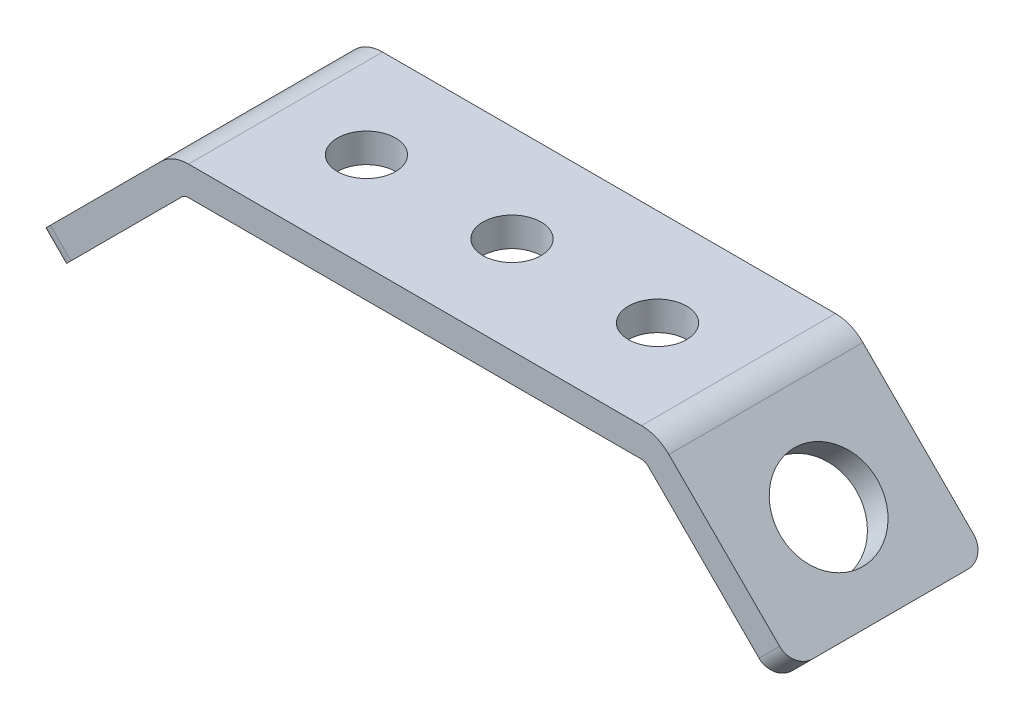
from build123d import *

# Parameters (mm, degrees)
BASE_EXTRUDE_THIN_DEPTH = 10
SKETCH2_R               = 3
CUT_EXTRUDE1_DEPTH      = 44.369309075
FILLET1_R               = 2
CUT_EXTRUDE2_REACH      = 61.761
SKETCH3_R               = 5


with BuildPart() as part:
    # Sketch1 → Base-Extrude-Thin (new, symmetric)
    with BuildSketch(Plane.XY):
        with BuildLine():
            Line((-39, -14), (-26.171572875, -1.171572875))
            ThreePointArc((-26.171572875, -1.171572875), (-24.87387948, -0.30448187), (-23.343145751, 0))
            Line((-23.343145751, 0), (23.343145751, 0))
            ThreePointArc((23.343145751, 0), (24.87387948, -0.30448187), (26.171572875, -1.171572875))
            Line((26.171572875, -1.171572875), (39, -14))
            Line((39, -14), (36.878679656, -16.121320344))
            Line((36.878679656, -16.121320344), (24.050252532, -3.292893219))
            ThreePointArc((24.050252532, -3.292893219), (23.725829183, -3.076120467), (23.343145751, -3))
            Line((23.343145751, -3), (-23.343145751, -3))
            ThreePointArc((-23.343145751, -3), (-23.725829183, -3.076120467), (-24.050252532, -3.292893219))
            Line((-24.050252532, -3.292893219), (-36.878679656, -16.121320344))
            Line((-36.878679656, -16.121320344), (-39, -14))
        make_face()
    extrude(amount=BASE_EXTRUDE_THIN_DEPTH, both=True)

    # Sketch2 → Cut-Extrude1 (cut, through all)
    with BuildSketch(Plane(origin=(0, 0, 0), x_dir=(-1, 0, 0), z_dir=(0, 1, 0))):
        with Locations(Location((0, 0, 0), (0, 0, 90))):
            Circle(SKETCH2_R)
        with Locations(Location((-15, 0, 0), (0, 0, 90))):
            Circle(SKETCH2_R)
        with Locations(Location((15, 0, 0), (0, 0, 270))):
            Circle(SKETCH2_R)
    extrude(amount=-CUT_EXTRUDE1_DEPTH, mode=Mode.SUBTRACT)

    # Fillet1
    fillet1_edges = [part.edges().sort_by_distance(p)[0] for p in [
        (-37.939339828, -15.060660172, -10),
        (37.939339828, -15.060660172, 10),
        (-37.939339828, -15.060660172, 10),
        (37.939339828, -15.060660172, -10),
    ]]
    fillet(fillet1_edges, radius=FILLET1_R)

    # Sketch3 → Cut-Extrude2 (cut, up to next)
    with BuildSketch(Plane(origin=(12.5, 12.5, 0), x_dir=(0, 0, -1), z_dir=(0.707106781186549, 0.707106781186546, 0)), mode=Mode.PRIVATE) as cut_extrude2_sk1:
        with Locations(Location((0, -28.476659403, 0), (0, 0, 90))):
            Circle(SKETCH3_R)
    cut_extrude2_tool1 = extrude(cut_extrude2_sk1.sketch, amount=-CUT_EXTRUDE2_REACH, mode=Mode.PRIVATE) & part.part
    cut_extrude2 = cut_extrude2_tool1.solids().sort_by_distance((32.636039, -7.636039, 0))[0]
    add(cut_extrude2, mode=Mode.SUBTRACT)

    # Mirror1: Cut-Extrude2 across Right Plane
    add(cut_extrude2.mirror(Plane(origin=(0, 0, 0), x_dir=(0, 0, -1), z_dir=(1, 0, 0))), mode=Mode.SUBTRACT)


solid = part.part
